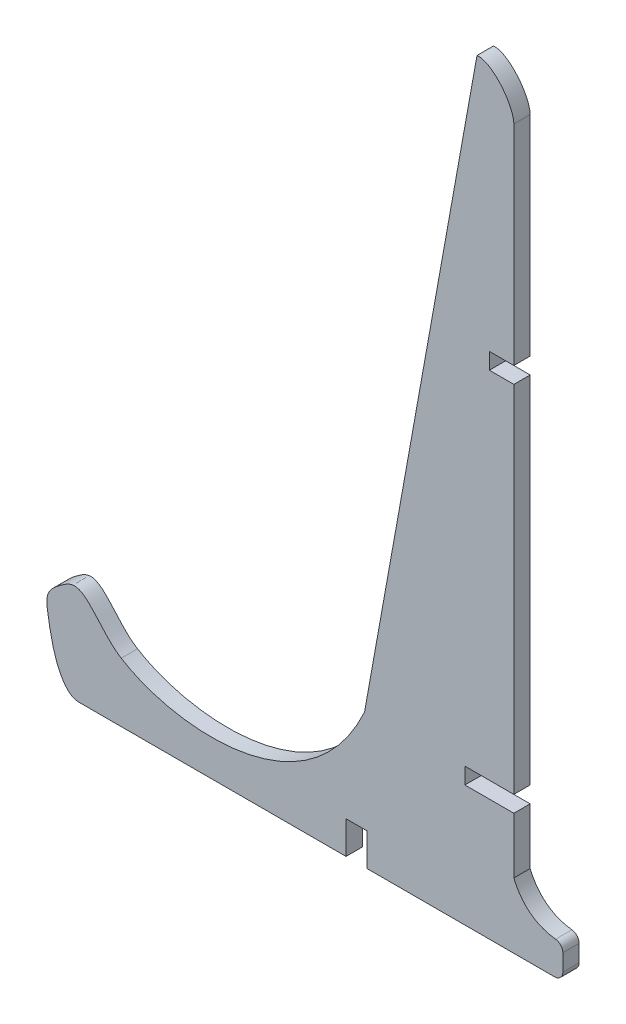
from build123d import *

# Parameters (mm, degrees)
BOSS_EXTRU_1_DEPTH      = 10
ESQUISSE2_W             = 30
ESQUISSE2_H             = 10
ESQUISSE2_W_2           = 15
ENL_V_MAT_EXTRU_1_DEPTH = 10
ESQUISSE3_W             = 12.8
ESQUISSE3_H             = 20
ENL_V_MAT_EXTRU_2_DEPTH = 10


with BuildPart() as part:
    # Esquisse1 → Boss.-Extru.1 (new body)
    with BuildSketch(Plane.XY):
        with BuildLine():
            Line((-5, 0), (-296.094580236, 0))
            ThreePointArc((-296.094580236, 0), (-299.89034709, 0.748397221), (-303.117965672, 2.881569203))
            add(Edge.make_bspline(
                [(-303.117965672, 2.881569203), (-308.578938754, 8.269627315), (-312.425113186, 20.482285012), (-317.167872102, 46.009028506), (-316.760306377, 50.558972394), (-293.009487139, 66.348272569), (-282.427783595, 43.371229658), (-270.510328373, 36.342986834)],
                knots=[0.041544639, 0.041544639, 0.041544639, 0.041544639, 0.264607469, 0.330645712, 0.660673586, 0.731734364, 1, 1, 1, 1], degree=3))
            add(Edge.make_bspline(
                [(-270.510328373, 36.342986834), (-237.121933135, 15.17917101), (-155.314196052, 8.321800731), (-121.474297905, 82.255475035)],
                knots=[0, 0, 0, 0, 1, 1, 1, 1], degree=3))
            Line((-121.474297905, 82.255475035), (-52.574571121, 465.090015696))
            add(Edge.make_bspline(
                [(-52.574571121, 465.090015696), (-43.29671191, 466.279484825), (-30.200013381, 449.899956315), (-30, 440)],
                knots=[0, 0, 0, 0, 1, 1, 1, 1], degree=3))
            Line((-30, 440), (-30, 40))
            add(Edge.make_bspline(
                [(-4.421903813, 20.271130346), (-16.247544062, 21.647633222), (-25.200660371, 28.480144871), (-30, 40)],
                knots=[0.107608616, 0.107608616, 0.107608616, 0.107608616, 1, 1, 1, 1], degree=3))
            ThreePointArc((-4.421903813, 20.271130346), (-1.265667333, 18.629532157), (0, 15.304662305))
            Line((0, 15.304662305), (0, 5))
            ThreePointArc((0, 5), (-1.464466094, 1.464466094), (-5, 0))
        make_face()
    extrude(amount=BOSS_EXTRU_1_DEPTH)

    # Esquisse2 → Enl_v. mat.-Extru.1 (cut)
    with BuildSketch(Plane.XY.offset(10)):
        with Locations((-45, 79.316864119)):
            Rectangle(ESQUISSE2_W, ESQUISSE2_H)
        with Locations((-37.5, 306.863689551)):
            Rectangle(ESQUISSE2_W_2, ESQUISSE2_H)
    extrude(amount=-ENL_V_MAT_EXTRU_1_DEPTH, mode=Mode.SUBTRACT)

    # Esquisse3 → Enl_v. mat.-Extru.2 (cut)
    with BuildSketch(Plane.XY.offset(10)):
        with Locations((-126.4, 10)):
            Rectangle(ESQUISSE3_W, ESQUISSE3_H)
    extrude(amount=-ENL_V_MAT_EXTRU_2_DEPTH, mode=Mode.SUBTRACT)


solid = part.part
